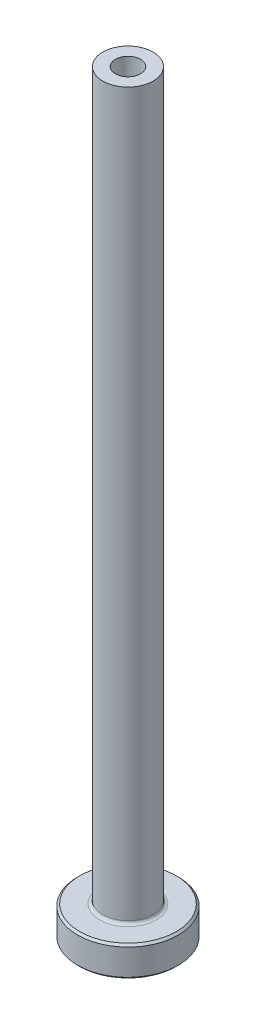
ISO-10303-21;
HEADER;
FILE_DESCRIPTION(('STEP AP214'),'2;1');
FILE_NAME('part.step','',(''),(''),'','','');
FILE_SCHEMA(('AUTOMOTIVE_DESIGN { 1 0 10303 214 1 1 1 1 }'));
ENDSEC;
DATA;
#1=APPLICATION_CONTEXT('core data for automotive mechanical design processes');
#2=APPLICATION_PROTOCOL_DEFINITION('international standard','automotive_design',2000,#1);
#3=PRODUCT_CONTEXT('',#1,'mechanical');
#4=PRODUCT('Part','Part','',(#3));
#5=PRODUCT_RELATED_PRODUCT_CATEGORY('part','',(#4));
#6=PRODUCT_DEFINITION_FORMATION('','',#4);
#7=PRODUCT_DEFINITION_CONTEXT('part definition',#1,'design');
#8=PRODUCT_DEFINITION('design','',#6,#7);
#9=PRODUCT_DEFINITION_SHAPE('','',#8);
#10=(LENGTH_UNIT() NAMED_UNIT(*) SI_UNIT(.MILLI.,.METRE.));
#11=(NAMED_UNIT(*) PLANE_ANGLE_UNIT() SI_UNIT($,.RADIAN.));
#12=(NAMED_UNIT(*) SI_UNIT($,.STERADIAN.) SOLID_ANGLE_UNIT());
#13=UNCERTAINTY_MEASURE_WITH_UNIT(LENGTH_MEASURE(1.E-05),#10,'distance_accuracy_value','');
#14=(GEOMETRIC_REPRESENTATION_CONTEXT(3) GLOBAL_UNCERTAINTY_ASSIGNED_CONTEXT((#13)) GLOBAL_UNIT_ASSIGNED_CONTEXT((#10,
#11,#12)) REPRESENTATION_CONTEXT('',''));
#15=CARTESIAN_POINT('',(0.,0.,0.));
#16=DIRECTION('',(0.,0.,1.));
#17=DIRECTION('',(1.,0.,0.));
#18=AXIS2_PLACEMENT_3D('',#15,#16,#17);
#19=CARTESIAN_POINT('',(0.,92.1876809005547,0.));
#20=DIRECTION('',(0.,1.,0.));
#21=DIRECTION('',(0.,0.,1.));
#22=AXIS2_PLACEMENT_3D('',#19,#20,#21);
#23=CYLINDRICAL_SURFACE('',#22,1.25000000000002);
#24=CARTESIAN_POINT('',(0.,75.,0.));
#25=DIRECTION('',(0.,1.,0.));
#26=DIRECTION('',(0.,0.,1.));
#27=AXIS2_PLACEMENT_3D('',#24,#25,#26);
#28=CIRCLE('',#27,1.25000000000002);
#29=CARTESIAN_POINT('',(0.,75.,1.25000000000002));
#30=VERTEX_POINT('',#29);
#31=EDGE_CURVE('E62',#30,#30,#28,.T.);
#32=ORIENTED_EDGE('',*,*,#31,.T.);
#33=EDGE_LOOP('',(#32));
#34=FACE_BOUND('',#33,.T.);
#35=CARTESIAN_POINT('',(0.,40.,0.));
#36=DIRECTION('',(0.,1.,0.));
#37=DIRECTION('',(0.,0.,1.));
#38=AXIS2_PLACEMENT_3D('',#35,#36,#37);
#39=CIRCLE('',#38,1.25000000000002);
#40=CARTESIAN_POINT('',(0.,40.,1.25000000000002));
#41=VERTEX_POINT('',#40);
#42=EDGE_CURVE('E71',#41,#41,#39,.T.);
#43=ORIENTED_EDGE('',*,*,#42,.F.);
#44=EDGE_LOOP('',(#43));
#45=FACE_BOUND('',#44,.T.);
#46=ADVANCED_FACE('F30',(#34,#45),#23,.F.);
#47=CARTESIAN_POINT('',(-1.25000000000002,75.,0.));
#48=DIRECTION('',(0.,1.,0.));
#49=DIRECTION('',(0.,0.,1.));
#50=AXIS2_PLACEMENT_3D('',#47,#48,#49);
#51=PLANE('',#50);
#52=CARTESIAN_POINT('',(0.,75.,0.));
#53=DIRECTION('',(0.,1.,0.));
#54=DIRECTION('',(0.,0.,1.));
#55=AXIS2_PLACEMENT_3D('',#52,#53,#54);
#56=CIRCLE('',#55,2.5);
#57=CARTESIAN_POINT('',(0.,75.,2.5));
#58=VERTEX_POINT('',#57);
#59=EDGE_CURVE('E65',#58,#58,#56,.T.);
#60=ORIENTED_EDGE('',*,*,#59,.T.);
#61=EDGE_LOOP('',(#60));
#62=FACE_BOUND('',#61,.T.);
#63=ORIENTED_EDGE('',*,*,#31,.F.);
#64=EDGE_LOOP('',(#63));
#65=FACE_BOUND('',#64,.T.);
#66=ADVANCED_FACE('F79',(#62,#65),#51,.T.);
#67=CARTESIAN_POINT('',(0.,92.1876809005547,0.));
#68=DIRECTION('',(0.,1.,0.));
#69=DIRECTION('',(0.,0.,1.));
#70=AXIS2_PLACEMENT_3D('',#67,#68,#69);
#71=CYLINDRICAL_SURFACE('',#70,2.49999999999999);
#72=CARTESIAN_POINT('',(0.,3.3,0.));
#73=DIRECTION('',(0.,1.,0.));
#74=DIRECTION('',(0.,0.,1.));
#75=AXIS2_PLACEMENT_3D('',#72,#73,#74);
#76=CIRCLE('',#75,2.49999999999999);
#77=CARTESIAN_POINT('',(0.,3.3,2.49999999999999));
#78=VERTEX_POINT('',#77);
#79=EDGE_CURVE('E59',#78,#78,#76,.T.);
#80=ORIENTED_EDGE('',*,*,#79,.T.);
#81=EDGE_LOOP('',(#80));
#82=FACE_BOUND('',#81,.T.);
#83=ORIENTED_EDGE('',*,*,#59,.F.);
#84=EDGE_LOOP('',(#83));
#85=FACE_BOUND('',#84,.T.);
#86=ADVANCED_FACE('F85',(#82,#85),#71,.T.);
#87=CARTESIAN_POINT('',(-2.49999999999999,3.,0.));
#88=DIRECTION('',(0.,1.,0.));
#89=DIRECTION('',(0.,0.,1.));
#90=AXIS2_PLACEMENT_3D('',#87,#88,#89);
#91=PLANE('',#90);
#92=CARTESIAN_POINT('',(0.,3.,0.));
#93=DIRECTION('',(0.,1.,0.));
#94=DIRECTION('',(0.,0.,1.));
#95=AXIS2_PLACEMENT_3D('',#92,#93,#94);
#96=CIRCLE('',#95,4.79999999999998);
#97=CARTESIAN_POINT('',(0.,3.,4.79999999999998));
#98=VERTEX_POINT('',#97);
#99=EDGE_CURVE('E53',#98,#98,#96,.T.);
#100=ORIENTED_EDGE('',*,*,#99,.T.);
#101=EDGE_LOOP('',(#100));
#102=FACE_BOUND('',#101,.T.);
#103=CARTESIAN_POINT('',(0.,3.,0.));
#104=DIRECTION('',(0.,1.,0.));
#105=DIRECTION('',(0.,0.,1.));
#106=AXIS2_PLACEMENT_3D('',#103,#104,#105);
#107=CIRCLE('',#106,2.79999999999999);
#108=CARTESIAN_POINT('',(0.,3.,2.79999999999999));
#109=VERTEX_POINT('',#108);
#110=EDGE_CURVE('E56',#109,#109,#107,.F.);
#111=ORIENTED_EDGE('',*,*,#110,.T.);
#112=EDGE_LOOP('',(#111));
#113=FACE_BOUND('',#112,.T.);
#114=ADVANCED_FACE('F111',(#102,#113),#91,.T.);
#115=CARTESIAN_POINT('',(0.,92.1876809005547,0.));
#116=DIRECTION('',(0.,1.,0.));
#117=DIRECTION('',(0.,0.,1.));
#118=AXIS2_PLACEMENT_3D('',#115,#116,#117);
#119=CYLINDRICAL_SURFACE('',#118,4.99999999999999);
#120=CARTESIAN_POINT('',(0.,2.79999999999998,0.));
#121=DIRECTION('',(0.,1.,0.));
#122=DIRECTION('',(0.,0.,1.));
#123=AXIS2_PLACEMENT_3D('',#120,#121,#122);
#124=CIRCLE('',#123,4.99999999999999);
#125=CARTESIAN_POINT('',(0.,2.79999999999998,4.99999999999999));
#126=VERTEX_POINT('',#125);
#127=EDGE_CURVE('E45',#126,#126,#124,.F.);
#128=ORIENTED_EDGE('',*,*,#127,.T.);
#129=EDGE_LOOP('',(#128));
#130=FACE_BOUND('',#129,.T.);
#131=CARTESIAN_POINT('',(0.,0.199999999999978,0.));
#132=DIRECTION('',(0.,-1.,0.));
#133=DIRECTION('',(0.,0.,-1.));
#134=AXIS2_PLACEMENT_3D('',#131,#132,#133);
#135=CIRCLE('',#134,4.99999999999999);
#136=CARTESIAN_POINT('',(0.,0.199999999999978,4.99999999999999));
#137=VERTEX_POINT('',#136);
#138=EDGE_CURVE('E50',#137,#137,#135,.F.);
#139=ORIENTED_EDGE('',*,*,#138,.T.);
#140=EDGE_LOOP('',(#139));
#141=FACE_BOUND('',#140,.T.);
#142=ADVANCED_FACE('F108',(#130,#141),#119,.T.);
#143=CARTESIAN_POINT('',(-4.99999999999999,0.,0.));
#144=DIRECTION('',(0.,-1.,0.));
#145=DIRECTION('',(0.,0.,-1.));
#146=AXIS2_PLACEMENT_3D('',#143,#144,#145);
#147=PLANE('',#146);
#148=CARTESIAN_POINT('',(0.,0.,0.));
#149=DIRECTION('',(0.,-1.,0.));
#150=DIRECTION('',(0.,0.,-1.));
#151=AXIS2_PLACEMENT_3D('',#148,#149,#150);
#152=CIRCLE('',#151,1.99999999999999);
#153=CARTESIAN_POINT('',(0.,0.,-1.99999999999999));
#154=VERTEX_POINT('',#153);
#155=EDGE_CURVE('E37',#154,#154,#152,.F.);
#156=ORIENTED_EDGE('',*,*,#155,.T.);
#157=EDGE_LOOP('',(#156));
#158=FACE_BOUND('',#157,.T.);
#159=CARTESIAN_POINT('',(0.,0.,0.));
#160=DIRECTION('',(0.,-1.,0.));
#161=DIRECTION('',(0.,0.,-1.));
#162=AXIS2_PLACEMENT_3D('',#159,#160,#161);
#163=CIRCLE('',#162,4.80000000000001);
#164=CARTESIAN_POINT('',(0.,0.,4.80000000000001));
#165=VERTEX_POINT('',#164);
#166=EDGE_CURVE('E41',#165,#165,#163,.T.);
#167=ORIENTED_EDGE('',*,*,#166,.T.);
#168=EDGE_LOOP('',(#167));
#169=FACE_BOUND('',#168,.T.);
#170=ADVANCED_FACE('F110',(#158,#169),#147,.T.);
#171=CARTESIAN_POINT('',(0.,92.1876809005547,0.));
#172=DIRECTION('',(0.,1.,0.));
#173=DIRECTION('',(0.,0.,1.));
#174=AXIS2_PLACEMENT_3D('',#171,#172,#173);
#175=CYLINDRICAL_SURFACE('',#174,1.49999999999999);
#176=CARTESIAN_POINT('',(0.,0.5,0.));
#177=DIRECTION('',(0.,-1.,0.));
#178=DIRECTION('',(0.,0.,-1.));
#179=AXIS2_PLACEMENT_3D('',#176,#177,#178);
#180=CIRCLE('',#179,1.49999999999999);
#181=CARTESIAN_POINT('',(0.,0.5,-1.49999999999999));
#182=VERTEX_POINT('',#181);
#183=EDGE_CURVE('E10',#182,#182,#180,.T.);
#184=ORIENTED_EDGE('',*,*,#183,.T.);
#185=EDGE_LOOP('',(#184));
#186=FACE_BOUND('',#185,.T.);
#187=CARTESIAN_POINT('',(0.,28.,0.));
#188=DIRECTION('',(0.,1.,0.));
#189=DIRECTION('',(0.,0.,1.));
#190=AXIS2_PLACEMENT_3D('',#187,#188,#189);
#191=CIRCLE('',#190,1.49999999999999);
#192=CARTESIAN_POINT('',(0.,28.,1.49999999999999));
#193=VERTEX_POINT('',#192);
#194=EDGE_CURVE('E68',#193,#193,#191,.T.);
#195=ORIENTED_EDGE('',*,*,#194,.T.);
#196=EDGE_LOOP('',(#195));
#197=FACE_BOUND('',#196,.T.);
#198=ADVANCED_FACE('F118',(#186,#197),#175,.F.);
#199=CARTESIAN_POINT('',(0.,28.,0.));
#200=DIRECTION('',(0.,-1.,0.));
#201=DIRECTION('',(0.,0.,-1.));
#202=AXIS2_PLACEMENT_3D('',#199,#200,#201);
#203=CONICAL_SURFACE('',#202,1.49999999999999,0.0208303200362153);
#204=ORIENTED_EDGE('',*,*,#42,.T.);
#205=EDGE_LOOP('',(#204));
#206=FACE_BOUND('',#205,.T.);
#207=ORIENTED_EDGE('',*,*,#194,.F.);
#208=EDGE_LOOP('',(#207));
#209=FACE_BOUND('',#208,.T.);
#210=ADVANCED_FACE('F75',(#206,#209),#203,.F.);
#211=CARTESIAN_POINT('',(0.,3.3,0.));
#212=DIRECTION('',(0.,1.,0.));
#213=DIRECTION('',(0.,0.,1.));
#214=AXIS2_PLACEMENT_3D('',#211,#212,#213);
#215=TOROIDAL_SURFACE('',#214,2.79999999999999,0.3);
#216=ORIENTED_EDGE('',*,*,#110,.F.);
#217=EDGE_LOOP('',(#216));
#218=FACE_BOUND('',#217,.T.);
#219=ORIENTED_EDGE('',*,*,#79,.F.);
#220=EDGE_LOOP('',(#219));
#221=FACE_BOUND('',#220,.T.);
#222=ADVANCED_FACE('F90',(#218,#221),#215,.F.);
#223=CARTESIAN_POINT('',(0.,3.,0.));
#224=DIRECTION('',(0.,-1.,0.));
#225=DIRECTION('',(0.,0.,-1.));
#226=AXIS2_PLACEMENT_3D('',#223,#224,#225);
#227=CONICAL_SURFACE('',#226,4.79999999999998,0.785398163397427);
#228=ORIENTED_EDGE('',*,*,#127,.F.);
#229=EDGE_LOOP('',(#228));
#230=FACE_BOUND('',#229,.T.);
#231=ORIENTED_EDGE('',*,*,#99,.F.);
#232=EDGE_LOOP('',(#231));
#233=FACE_BOUND('',#232,.T.);
#234=ADVANCED_FACE('F93',(#230,#233),#227,.T.);
#235=CARTESIAN_POINT('',(0.,0.199999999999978,0.));
#236=DIRECTION('',(0.,1.,0.));
#237=DIRECTION('',(0.,0.,1.));
#238=AXIS2_PLACEMENT_3D('',#235,#236,#237);
#239=CONICAL_SURFACE('',#238,4.99999999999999,0.785398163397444);
#240=CARTESIAN_POINT('',(0.,0.,4.80000000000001));
#241=CARTESIAN_POINT('',(0.,0.00208333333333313,4.80208333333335));
#242=CARTESIAN_POINT('',(0.,0.00416666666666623,4.80416666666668));
#243=CARTESIAN_POINT('',(0.,0.00833333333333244,4.80833333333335));
#244=CARTESIAN_POINT('',(0.,0.0104166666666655,4.81041666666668));
#245=CARTESIAN_POINT('',(0.,0.0145833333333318,4.81458333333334));
#246=CARTESIAN_POINT('',(0.,0.0166666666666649,4.81666666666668));
#247=CARTESIAN_POINT('',(0.,0.0208333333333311,4.82083333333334));
#248=CARTESIAN_POINT('',(0.,0.0229166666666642,4.82291666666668));
#249=CARTESIAN_POINT('',(0.,0.0270833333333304,4.82708333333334));
#250=CARTESIAN_POINT('',(0.,0.0291666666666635,4.82916666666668));
#251=CARTESIAN_POINT('',(0.,0.0333333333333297,4.83333333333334));
#252=CARTESIAN_POINT('',(0.,0.0354166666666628,4.83541666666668));
#253=CARTESIAN_POINT('',(0.,0.039583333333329,4.83958333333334));
#254=CARTESIAN_POINT('',(0.,0.0416666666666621,4.84166666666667));
#255=CARTESIAN_POINT('',(0.,0.0458333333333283,4.84583333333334));
#256=CARTESIAN_POINT('',(0.,0.0479166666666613,4.84791666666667));
#257=CARTESIAN_POINT('',(0.,0.0520833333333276,4.85208333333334));
#258=CARTESIAN_POINT('',(0.,0.0541666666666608,4.85416666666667));
#259=CARTESIAN_POINT('',(0.,0.058333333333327,4.85833333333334));
#260=CARTESIAN_POINT('',(0.,0.0604166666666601,4.86041666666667));
#261=CARTESIAN_POINT('',(0.,0.0645833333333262,4.86458333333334));
#262=CARTESIAN_POINT('',(0.,0.0666666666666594,4.86666666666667));
#263=CARTESIAN_POINT('',(0.,0.0708333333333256,4.87083333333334));
#264=CARTESIAN_POINT('',(0.,0.0729166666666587,4.87291666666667));
#265=CARTESIAN_POINT('',(0.,0.0770833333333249,4.87708333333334));
#266=CARTESIAN_POINT('',(0.,0.079166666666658,4.87916666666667));
#267=CARTESIAN_POINT('',(0.,0.0833333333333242,4.88333333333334));
#268=CARTESIAN_POINT('',(0.,0.0854166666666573,4.88541666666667));
#269=CARTESIAN_POINT('',(0.,0.0895833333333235,4.88958333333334));
#270=CARTESIAN_POINT('',(0.,0.0916666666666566,4.89166666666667));
#271=CARTESIAN_POINT('',(0.,0.0958333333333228,4.89583333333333));
#272=CARTESIAN_POINT('',(0.,0.0979166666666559,4.89791666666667));
#273=CARTESIAN_POINT('',(0.,0.102083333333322,4.90208333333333));
#274=CARTESIAN_POINT('',(0.,0.104166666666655,4.90416666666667));
#275=CARTESIAN_POINT('',(0.,0.108333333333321,4.90833333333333));
#276=CARTESIAN_POINT('',(0.,0.110416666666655,4.91041666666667));
#277=CARTESIAN_POINT('',(0.,0.114583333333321,4.91458333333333));
#278=CARTESIAN_POINT('',(0.,0.116666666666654,4.91666666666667));
#279=CARTESIAN_POINT('',(0.,0.12083333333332,4.92083333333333));
#280=CARTESIAN_POINT('',(0.,0.122916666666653,4.92291666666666));
#281=CARTESIAN_POINT('',(0.,0.127083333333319,4.92708333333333));
#282=CARTESIAN_POINT('',(0.,0.129166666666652,4.92916666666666));
#283=CARTESIAN_POINT('',(0.,0.133333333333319,4.93333333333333));
#284=CARTESIAN_POINT('',(0.,0.135416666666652,4.93541666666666));
#285=CARTESIAN_POINT('',(0.,0.139583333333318,4.93958333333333));
#286=CARTESIAN_POINT('',(0.,0.141666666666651,4.94166666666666));
#287=CARTESIAN_POINT('',(0.,0.145833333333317,4.94583333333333));
#288=CARTESIAN_POINT('',(0.,0.14791666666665,4.94791666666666));
#289=CARTESIAN_POINT('',(0.,0.152083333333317,4.95208333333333));
#290=CARTESIAN_POINT('',(0.,0.15416666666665,4.95416666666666));
#291=CARTESIAN_POINT('',(0.,0.158333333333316,4.95833333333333));
#292=CARTESIAN_POINT('',(0.,0.160416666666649,4.96041666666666));
#293=CARTESIAN_POINT('',(0.,0.164583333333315,4.96458333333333));
#294=CARTESIAN_POINT('',(0.,0.166666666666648,4.96666666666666));
#295=CARTESIAN_POINT('',(0.,0.170833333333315,4.97083333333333));
#296=CARTESIAN_POINT('',(0.,0.172916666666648,4.97291666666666));
#297=CARTESIAN_POINT('',(0.,0.177083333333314,4.97708333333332));
#298=CARTESIAN_POINT('',(0.,0.179166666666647,4.97916666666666));
#299=CARTESIAN_POINT('',(0.,0.183333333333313,4.98333333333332));
#300=CARTESIAN_POINT('',(0.,0.185416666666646,4.98541666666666));
#301=CARTESIAN_POINT('',(0.,0.189583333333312,4.98958333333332));
#302=CARTESIAN_POINT('',(0.,0.191666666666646,4.99166666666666));
#303=CARTESIAN_POINT('',(0.,0.195833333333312,4.99583333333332));
#304=CARTESIAN_POINT('',(0.,0.197916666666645,4.99791666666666));
#305=CARTESIAN_POINT('',(0.,0.199999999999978,4.99999999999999));
#306=B_SPLINE_CURVE_WITH_KNOTS('',3,(#240,#241,#242,#243,#244,#245,#246,#247,#248,#249,#250,
#251,#252,#253,#254,#255,#256,#257,#258,#259,#260,#261,#262,#263,#264,#265,#266,#267,#268,#269,
#270,#271,#272,#273,#274,#275,#276,#277,#278,#279,#280,#281,#282,#283,#284,#285,#286,#287,#288,
#289,#290,#291,#292,#293,#294,#295,#296,#297,#298,#299,#300,#301,#302,#303,#304,#305),
.UNSPECIFIED.,.F.,.F.,(4,2,2,2,2,2,2,2,2,2,2,2,2,2,2,2,2,2,2,2,2,2,2,2,2,2,2,2,2,2,2,2,4),(0.,
0.00883883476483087,0.0176776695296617,0.0265165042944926,0.0353553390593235,0.0441941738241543,
0.0530330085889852,0.0618718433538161,0.070710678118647,0.0795495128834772,0.0883883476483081,
0.0972271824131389,0.10606601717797,0.114904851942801,0.123743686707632,0.132582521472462,
0.141421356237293,0.150260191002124,0.159099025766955,0.167937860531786,0.176776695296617,
0.185615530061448,0.194454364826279,0.203293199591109,0.21213203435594,0.220970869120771,
0.229809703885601,0.238648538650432,0.247487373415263,0.256326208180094,0.265165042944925,
0.274003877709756,0.282842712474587),.UNSPECIFIED.);
#307=EDGE_CURVE('BSEAM96',#165,#137,#306,.T.);
#308=ORIENTED_EDGE('',*,*,#166,.F.);
#309=ORIENTED_EDGE('',*,*,#138,.F.);
#310=ORIENTED_EDGE('',*,*,#307,.T.);
#311=ORIENTED_EDGE('',*,*,#307,.F.);
#312=EDGE_LOOP('',(#308,#310,#309,#311));
#313=FACE_BOUND('',#312,.T.);
#314=ADVANCED_FACE('F96',(#313),#239,.T.);
#315=CARTESIAN_POINT('',(0.,0.,0.));
#316=DIRECTION('',(0.,-1.,0.));
#317=DIRECTION('',(0.,0.,-1.));
#318=AXIS2_PLACEMENT_3D('',#315,#316,#317);
#319=CONICAL_SURFACE('',#318,1.99999999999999,0.785398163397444);
#320=ORIENTED_EDGE('',*,*,#183,.F.);
#321=EDGE_LOOP('',(#320));
#322=FACE_BOUND('',#321,.T.);
#323=ORIENTED_EDGE('',*,*,#155,.F.);
#324=EDGE_LOOP('',(#323));
#325=FACE_BOUND('',#324,.T.);
#326=ADVANCED_FACE('F32',(#322,#325),#319,.F.);
#327=CLOSED_SHELL('',(#46,#66,#86,#114,#142,#170,#198,#210,#222,#234,#314,#326));
#328=MANIFOLD_SOLID_BREP('B2',#327);
#329=ADVANCED_BREP_SHAPE_REPRESENTATION('',(#18,#328),#14);
#330=SHAPE_DEFINITION_REPRESENTATION(#9,#329);
ENDSEC;
END-ISO-10303-21;
